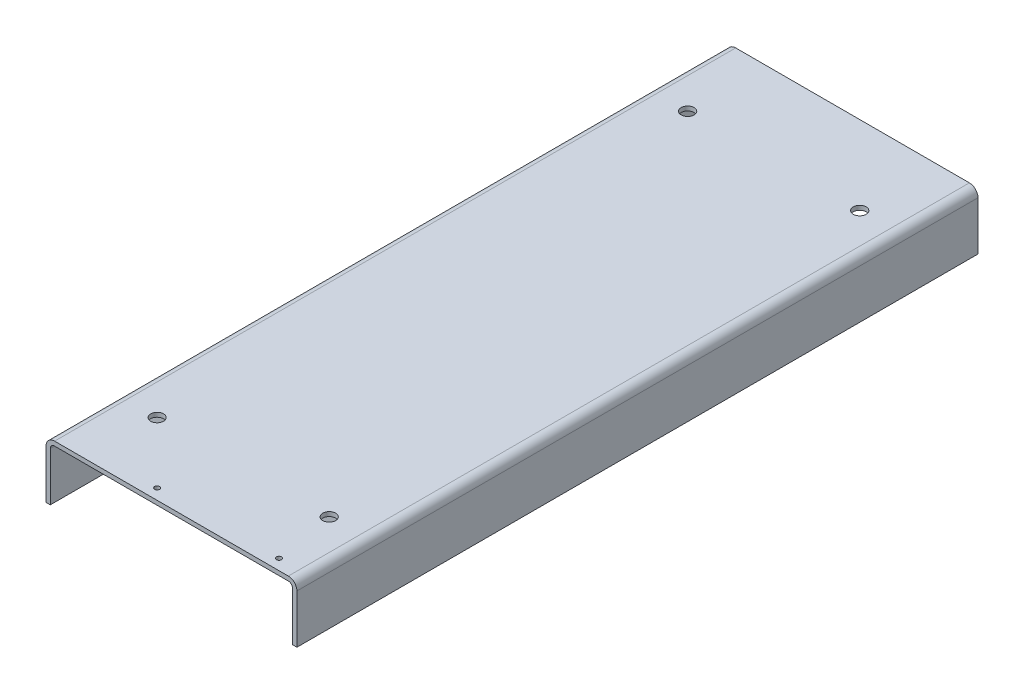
from build123d import *

# Parameters (mm, degrees)
EXTRU_MINCE1_DEPTH         = 950
ESQUISSE2_R                = 3.5
ENL_V_MAT_EXTRU_1_DEPTH    = 6
ESQUISSE3_R                = 3.5
EXTRUSION1_DEPTH           = 6
ESQUISSE4_R                = 9
ENL_V_MAT_EXTRU_2_DEPTH    = 6
NERVURE1_REACH             = 834.541
ESQUISSE5_WALL_W           = 2005.082580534
ESQUISSE5_WALL_H           = 6
R_P_TITION_LIN_AIRE1_COUNT = 2
R_P_TITION_LIN_AIRE1_PITCH = 670


with BuildPart() as part:
    # Esquisse1 → Extru.-Mince1 (new body)
    with BuildSketch(Plane.XY):
        with BuildLine():
            Line((-175, 0), (-175, 68))
            ThreePointArc((-175, 68), (-171.485281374, 76.485281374), (-163, 80))
            Line((-163, 80), (163, 80))
            ThreePointArc((163, 80), (171.485281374, 76.485281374), (175, 68))
            Line((175, 68), (175, 0))
            Line((175, 0), (169, 0))
            Line((169, 0), (169, 68))
            ThreePointArc((169, 68), (167.242640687, 72.242640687), (163, 74))
            Line((163, 74), (-163, 74))
            ThreePointArc((-163, 74), (-167.242640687, 72.242640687), (-169, 68))
            Line((-169, 68), (-169, 0))
            Line((-169, 0), (-175, 0))
        make_face()
    extrude(amount=-EXTRU_MINCE1_DEPTH)

    # Esquisse2 → Enl_v. mat.-Extru.1 (cut)
    with BuildSketch(Plane(origin=(0, 80, 0), x_dir=(-1, 0, 0), z_dir=(0, 1, 0))):
        with Locations(Location((35, -15, 0), (0, 0, 90))):
            Circle(ESQUISSE2_R)
        with Locations(Location((-135, -15, 0), (0, 0, 90))):
            Circle(ESQUISSE2_R)
    extrude(amount=-ENL_V_MAT_EXTRU_1_DEPTH, mode=Mode.SUBTRACT)

    # Esquisse3 → Extrusion1 (add)
    # profile 1 of 2: a face of its own
    with BuildSketch(Plane.XZ.offset(-74)):
        Polygon((142.505553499, -15), (138.75277675, -8.5), (131.24722325, -8.5), (127.494446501, -15), (131.24722325, -21.5), (138.75277675, -21.5), align=None)
        with Locations(Location((135, -15, 0), (0, 0, 90))):
            Circle(ESQUISSE3_R, mode=Mode.SUBTRACT)
    # profile 2 of 2: a face of its own
    with BuildSketch(Plane.XZ.offset(-74)):
        Polygon((-27.494446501, -15), (-31.24722325, -8.5), (-38.75277675, -8.5), (-42.505553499, -15), (-38.75277675, -21.5), (-31.24722325, -21.5), align=None)
        with Locations(Location((-35, -15, 0), (0, 0, 90))):
            Circle(ESQUISSE3_R, mode=Mode.SUBTRACT)
    extrude(amount=EXTRUSION1_DEPTH)

    # Esquisse4 → Enl_v. mat.-Extru.2 (cut)
    with BuildSketch(Plane(origin=(0, 80, 0), x_dir=(-1, 0, 0), z_dir=(0, 1, 0))):
        with Locations(Location((-120, -100, 0), (0, 0, 90))):
            Circle(ESQUISSE4_R)
        with Locations(Location((-120, -840, 0), (0, 0, 90))):
            Circle(ESQUISSE4_R)
        with Locations(Location((120, -840, 0), (0, 0, 90))):
            Circle(ESQUISSE4_R)
        with Locations(Location((120, -100, 0), (0, 0, 90))):
            Circle(ESQUISSE4_R)
    extrude(amount=-ENL_V_MAT_EXTRU_2_DEPTH, mode=Mode.SUBTRACT)

    # Esquisse5 wall → Nervure1 (add, up to next)
    with BuildSketch(Plane(origin=(0, 0, -140), x_dir=(1, 0, 0), z_dir=(0, 1, 0)), mode=Mode.PRIVATE) as nervure1_sk1:
        Rectangle(ESQUISSE5_WALL_W, ESQUISSE5_WALL_H)
    nervure1_tool1 = extrude(nervure1_sk1.sketch, amount=NERVURE1_REACH, mode=Mode.PRIVATE) - part.part
    nervure1 = nervure1_tool1.solids().sort_by_distance((0, 0, -140))[0]
    add(nervure1)

    # R_p_tition lin_aire1: Nervure1 ×2
    with Locations(*[(0, 0, -i * R_P_TITION_LIN_AIRE1_PITCH) for i in range(1, R_P_TITION_LIN_AIRE1_COUNT)]):
        add(nervure1)


solid = part.part
